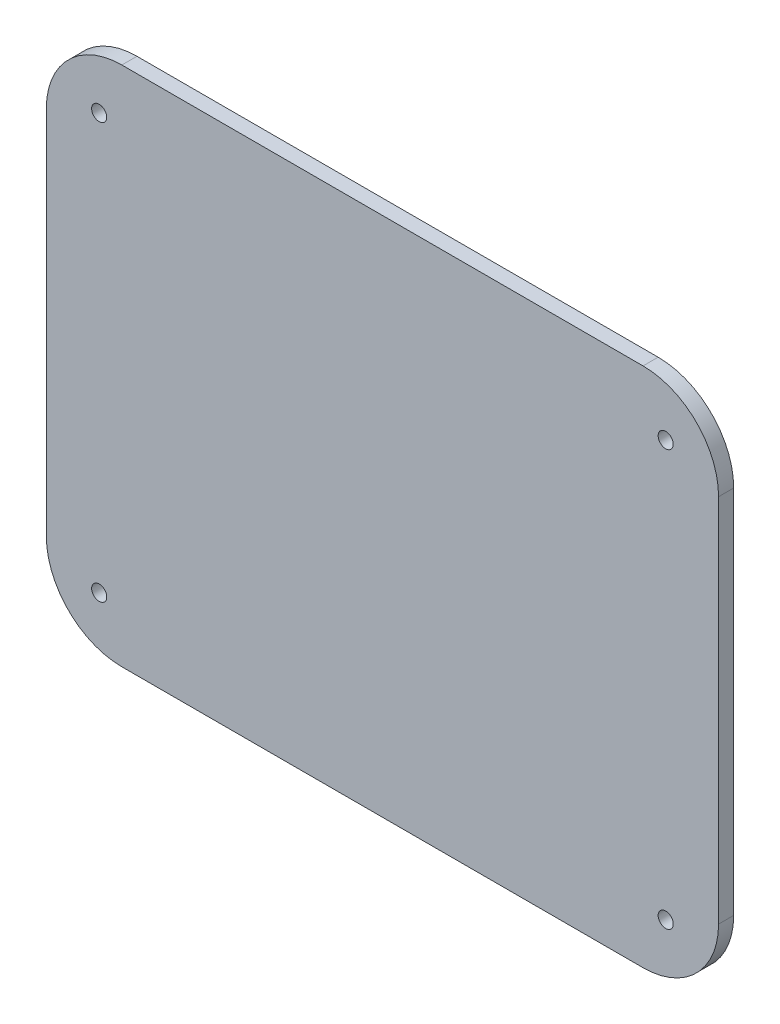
ISO-10303-21;
HEADER;
FILE_DESCRIPTION(('STEP AP214'),'2;1');
FILE_NAME('part.step','',(''),(''),'','','');
FILE_SCHEMA(('AUTOMOTIVE_DESIGN { 1 0 10303 214 1 1 1 1 }'));
ENDSEC;
DATA;
#1=APPLICATION_CONTEXT('core data for automotive mechanical design processes');
#2=APPLICATION_PROTOCOL_DEFINITION('international standard','automotive_design',2000,#1);
#3=PRODUCT_CONTEXT('',#1,'mechanical');
#4=PRODUCT('Part','Part','',(#3));
#5=PRODUCT_RELATED_PRODUCT_CATEGORY('part','',(#4));
#6=PRODUCT_DEFINITION_FORMATION('','',#4);
#7=PRODUCT_DEFINITION_CONTEXT('part definition',#1,'design');
#8=PRODUCT_DEFINITION('design','',#6,#7);
#9=PRODUCT_DEFINITION_SHAPE('','',#8);
#10=(LENGTH_UNIT() NAMED_UNIT(*) SI_UNIT(.MILLI.,.METRE.));
#11=(NAMED_UNIT(*) PLANE_ANGLE_UNIT() SI_UNIT($,.RADIAN.));
#12=(NAMED_UNIT(*) SI_UNIT($,.STERADIAN.) SOLID_ANGLE_UNIT());
#13=UNCERTAINTY_MEASURE_WITH_UNIT(LENGTH_MEASURE(1.E-05),#10,'distance_accuracy_value','');
#14=(GEOMETRIC_REPRESENTATION_CONTEXT(3) GLOBAL_UNCERTAINTY_ASSIGNED_CONTEXT((#13)) GLOBAL_UNIT_ASSIGNED_CONTEXT((#10,
#11,#12)) REPRESENTATION_CONTEXT('',''));
#15=CARTESIAN_POINT('',(0.,0.,0.));
#16=DIRECTION('',(0.,0.,1.));
#17=DIRECTION('',(1.,0.,0.));
#18=AXIS2_PLACEMENT_3D('',#15,#16,#17);
#19=CARTESIAN_POINT('',(79.,-59.,-2.));
#20=DIRECTION('',(0.,0.,1.));
#21=DIRECTION('',(1.,0.,0.));
#22=AXIS2_PLACEMENT_3D('',#19,#20,#21);
#23=CYLINDRICAL_SURFACE('',#22,9.99999999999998);
#24=CARTESIAN_POINT('',(79.,-59.,0.));
#25=DIRECTION('',(0.,0.,1.));
#26=DIRECTION('',(1.,0.,0.));
#27=AXIS2_PLACEMENT_3D('',#24,#25,#26);
#28=CIRCLE('',#27,9.99999999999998);
#29=CARTESIAN_POINT('',(79.,-69.,0.));
#30=VERTEX_POINT('',#29);
#31=CARTESIAN_POINT('',(89.,-59.,0.));
#32=VERTEX_POINT('',#31);
#33=EDGE_CURVE('E146',#30,#32,#28,.T.);
#34=ORIENTED_EDGE('',*,*,#33,.F.);
#35=DIRECTION('',(0.,0.,1.));
#36=VECTOR('',#35,1.);
#37=CARTESIAN_POINT('',(79.,-69.,-2.));
#38=LINE('',#37,#36);
#39=CARTESIAN_POINT('',(79.,-69.,-2.));
#40=VERTEX_POINT('',#39);
#41=EDGE_CURVE('E11',#40,#30,#38,.T.);
#42=ORIENTED_EDGE('',*,*,#41,.F.);
#43=CARTESIAN_POINT('',(79.,-59.,-2.));
#44=DIRECTION('',(0.,0.,1.));
#45=DIRECTION('',(1.,0.,0.));
#46=AXIS2_PLACEMENT_3D('',#43,#44,#45);
#47=CIRCLE('',#46,9.99999999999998);
#48=CARTESIAN_POINT('',(89.,-59.,-2.));
#49=VERTEX_POINT('',#48);
#50=EDGE_CURVE('E176',#40,#49,#47,.T.);
#51=ORIENTED_EDGE('',*,*,#50,.T.);
#52=DIRECTION('',(0.,0.,1.));
#53=VECTOR('',#52,1.);
#54=CARTESIAN_POINT('',(89.,-59.,-2.));
#55=LINE('',#54,#53);
#56=EDGE_CURVE('E40',#49,#32,#55,.T.);
#57=ORIENTED_EDGE('',*,*,#56,.T.);
#58=EDGE_LOOP('',(#34,#42,#51,#57));
#59=FACE_BOUND('',#58,.T.);
#60=ADVANCED_FACE('F37',(#59),#23,.T.);
#61=CARTESIAN_POINT('',(0.,-69.,-2.));
#62=DIRECTION('',(0.,-1.,0.));
#63=DIRECTION('',(0.,0.,-1.));
#64=AXIS2_PLACEMENT_3D('',#61,#62,#63);
#65=PLANE('',#64);
#66=DIRECTION('',(1.,0.,0.));
#67=VECTOR('',#66,1.);
#68=CARTESIAN_POINT('',(0.,-69.,0.));
#69=LINE('',#68,#67);
#70=CARTESIAN_POINT('',(10.0000000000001,-69.,0.));
#71=VERTEX_POINT('',#70);
#72=EDGE_CURVE('E162',#71,#30,#69,.T.);
#73=ORIENTED_EDGE('',*,*,#72,.F.);
#74=DIRECTION('',(0.,0.,1.));
#75=VECTOR('',#74,1.);
#76=CARTESIAN_POINT('',(10.0000000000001,-69.,-2.));
#77=LINE('',#76,#75);
#78=CARTESIAN_POINT('',(10.0000000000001,-69.,-2.));
#79=VERTEX_POINT('',#78);
#80=EDGE_CURVE('E46',#79,#71,#77,.T.);
#81=ORIENTED_EDGE('',*,*,#80,.F.);
#82=DIRECTION('',(1.,0.,0.));
#83=VECTOR('',#82,1.);
#84=CARTESIAN_POINT('',(0.,-69.,-2.));
#85=LINE('',#84,#83);
#86=EDGE_CURVE('E124',#79,#40,#85,.T.);
#87=ORIENTED_EDGE('',*,*,#86,.T.);
#88=ORIENTED_EDGE('',*,*,#41,.T.);
#89=EDGE_LOOP('',(#73,#81,#87,#88));
#90=FACE_BOUND('',#89,.T.);
#91=ADVANCED_FACE('F194',(#90),#65,.T.);
#92=CARTESIAN_POINT('',(10.,-59.,-2.));
#93=DIRECTION('',(0.,0.,1.));
#94=DIRECTION('',(1.,0.,0.));
#95=AXIS2_PLACEMENT_3D('',#92,#93,#94);
#96=CYLINDRICAL_SURFACE('',#95,10.);
#97=CARTESIAN_POINT('',(10.,-59.,0.));
#98=DIRECTION('',(0.,0.,1.));
#99=DIRECTION('',(1.,0.,0.));
#100=AXIS2_PLACEMENT_3D('',#97,#98,#99);
#101=CIRCLE('',#100,10.);
#102=CARTESIAN_POINT('',(0.,-58.9999999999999,0.));
#103=VERTEX_POINT('',#102);
#104=EDGE_CURVE('E111',#103,#71,#101,.T.);
#105=ORIENTED_EDGE('',*,*,#104,.F.);
#106=DIRECTION('',(0.,0.,1.));
#107=VECTOR('',#106,1.);
#108=CARTESIAN_POINT('',(0.,-58.9999999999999,-2.));
#109=LINE('',#108,#107);
#110=CARTESIAN_POINT('',(0.,-58.9999999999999,-2.));
#111=VERTEX_POINT('',#110);
#112=EDGE_CURVE('E106',#111,#103,#109,.T.);
#113=ORIENTED_EDGE('',*,*,#112,.F.);
#114=CARTESIAN_POINT('',(10.,-59.,-2.));
#115=DIRECTION('',(0.,0.,1.));
#116=DIRECTION('',(1.,0.,0.));
#117=AXIS2_PLACEMENT_3D('',#114,#115,#116);
#118=CIRCLE('',#117,10.);
#119=EDGE_CURVE('E109',#111,#79,#118,.T.);
#120=ORIENTED_EDGE('',*,*,#119,.T.);
#121=ORIENTED_EDGE('',*,*,#80,.T.);
#122=EDGE_LOOP('',(#105,#113,#120,#121));
#123=FACE_BOUND('',#122,.T.);
#124=ADVANCED_FACE('F108',(#123),#96,.T.);
#125=CARTESIAN_POINT('',(0.,0.,-2.));
#126=DIRECTION('',(-1.,0.,0.));
#127=DIRECTION('',(0.,-1.,0.));
#128=AXIS2_PLACEMENT_3D('',#125,#126,#127);
#129=PLANE('',#128);
#130=DIRECTION('',(0.,-1.,0.));
#131=VECTOR('',#130,1.);
#132=CARTESIAN_POINT('',(0.,0.,0.));
#133=LINE('',#132,#131);
#134=CARTESIAN_POINT('',(0.,-10.0000000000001,0.));
#135=VERTEX_POINT('',#134);
#136=EDGE_CURVE('E159',#135,#103,#133,.T.);
#137=ORIENTED_EDGE('',*,*,#136,.F.);
#138=DIRECTION('',(0.,0.,1.));
#139=VECTOR('',#138,1.);
#140=CARTESIAN_POINT('',(0.,-10.0000000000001,-2.));
#141=LINE('',#140,#139);
#142=CARTESIAN_POINT('',(0.,-10.0000000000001,-2.));
#143=VERTEX_POINT('',#142);
#144=EDGE_CURVE('E116',#143,#135,#141,.T.);
#145=ORIENTED_EDGE('',*,*,#144,.F.);
#146=DIRECTION('',(0.,-1.,0.));
#147=VECTOR('',#146,1.);
#148=CARTESIAN_POINT('',(0.,0.,-2.));
#149=LINE('',#148,#147);
#150=EDGE_CURVE('E122',#143,#111,#149,.T.);
#151=ORIENTED_EDGE('',*,*,#150,.T.);
#152=ORIENTED_EDGE('',*,*,#112,.T.);
#153=EDGE_LOOP('',(#137,#145,#151,#152));
#154=FACE_BOUND('',#153,.T.);
#155=ADVANCED_FACE('F126',(#154),#129,.T.);
#156=CARTESIAN_POINT('',(10.,-10.,-2.));
#157=DIRECTION('',(0.,0.,1.));
#158=DIRECTION('',(1.,0.,0.));
#159=AXIS2_PLACEMENT_3D('',#156,#157,#158);
#160=CYLINDRICAL_SURFACE('',#159,10.);
#161=CARTESIAN_POINT('',(10.,-10.,0.));
#162=DIRECTION('',(0.,0.,1.));
#163=DIRECTION('',(1.,0.,0.));
#164=AXIS2_PLACEMENT_3D('',#161,#162,#163);
#165=CIRCLE('',#164,10.);
#166=CARTESIAN_POINT('',(10.0000000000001,0.,0.));
#167=VERTEX_POINT('',#166);
#168=EDGE_CURVE('E156',#167,#135,#165,.T.);
#169=ORIENTED_EDGE('',*,*,#168,.F.);
#170=DIRECTION('',(0.,0.,1.));
#171=VECTOR('',#170,1.);
#172=CARTESIAN_POINT('',(10.0000000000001,0.,-2.));
#173=LINE('',#172,#171);
#174=CARTESIAN_POINT('',(10.0000000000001,0.,-2.));
#175=VERTEX_POINT('',#174);
#176=EDGE_CURVE('E180',#175,#167,#173,.T.);
#177=ORIENTED_EDGE('',*,*,#176,.F.);
#178=CARTESIAN_POINT('',(10.,-10.,-2.));
#179=DIRECTION('',(0.,0.,1.));
#180=DIRECTION('',(1.,0.,0.));
#181=AXIS2_PLACEMENT_3D('',#178,#179,#180);
#182=CIRCLE('',#181,10.);
#183=EDGE_CURVE('E127',#175,#143,#182,.T.);
#184=ORIENTED_EDGE('',*,*,#183,.T.);
#185=ORIENTED_EDGE('',*,*,#144,.T.);
#186=EDGE_LOOP('',(#169,#177,#184,#185));
#187=FACE_BOUND('',#186,.T.);
#188=ADVANCED_FACE('F208',(#187),#160,.T.);
#189=CARTESIAN_POINT('',(0.,0.,-2.));
#190=DIRECTION('',(0.,-1.,0.));
#191=DIRECTION('',(1.,0.,0.));
#192=AXIS2_PLACEMENT_3D('',#189,#190,#191);
#193=PLANE('',#192);
#194=DIRECTION('',(1.,0.,0.));
#195=VECTOR('',#194,1.);
#196=CARTESIAN_POINT('',(0.,0.,0.));
#197=LINE('',#196,#195);
#198=CARTESIAN_POINT('',(79.,0.,0.));
#199=VERTEX_POINT('',#198);
#200=EDGE_CURVE('E154',#167,#199,#197,.T.);
#201=ORIENTED_EDGE('',*,*,#200,.T.);
#202=DIRECTION('',(0.,0.,1.));
#203=VECTOR('',#202,1.);
#204=CARTESIAN_POINT('',(79.,0.,-2.));
#205=LINE('',#204,#203);
#206=CARTESIAN_POINT('',(79.,0.,-2.));
#207=VERTEX_POINT('',#206);
#208=EDGE_CURVE('E182',#207,#199,#205,.T.);
#209=ORIENTED_EDGE('',*,*,#208,.F.);
#210=DIRECTION('',(1.,0.,0.));
#211=VECTOR('',#210,1.);
#212=CARTESIAN_POINT('',(0.,0.,-2.));
#213=LINE('',#212,#211);
#214=EDGE_CURVE('E129',#175,#207,#213,.T.);
#215=ORIENTED_EDGE('',*,*,#214,.F.);
#216=ORIENTED_EDGE('',*,*,#176,.T.);
#217=EDGE_LOOP('',(#201,#209,#215,#216));
#218=FACE_BOUND('',#217,.T.);
#219=ADVANCED_FACE('F211',(#218),#193,.F.);
#220=CARTESIAN_POINT('',(79.,-10.,-2.));
#221=DIRECTION('',(0.,0.,1.));
#222=DIRECTION('',(1.,0.,0.));
#223=AXIS2_PLACEMENT_3D('',#220,#221,#222);
#224=CYLINDRICAL_SURFACE('',#223,9.99999999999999);
#225=CARTESIAN_POINT('',(79.,-10.,0.));
#226=DIRECTION('',(0.,0.,1.));
#227=DIRECTION('',(1.,0.,0.));
#228=AXIS2_PLACEMENT_3D('',#225,#226,#227);
#229=CIRCLE('',#228,9.99999999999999);
#230=CARTESIAN_POINT('',(89.,-10.,0.));
#231=VERTEX_POINT('',#230);
#232=EDGE_CURVE('E152',#199,#231,#229,.F.);
#233=ORIENTED_EDGE('',*,*,#232,.T.);
#234=DIRECTION('',(0.,0.,1.));
#235=VECTOR('',#234,1.);
#236=CARTESIAN_POINT('',(89.,-10.,-2.));
#237=LINE('',#236,#235);
#238=CARTESIAN_POINT('',(89.,-10.,-2.));
#239=VERTEX_POINT('',#238);
#240=EDGE_CURVE('E184',#239,#231,#237,.T.);
#241=ORIENTED_EDGE('',*,*,#240,.F.);
#242=CARTESIAN_POINT('',(79.,-10.,-2.));
#243=DIRECTION('',(0.,0.,1.));
#244=DIRECTION('',(1.,0.,0.));
#245=AXIS2_PLACEMENT_3D('',#242,#243,#244);
#246=CIRCLE('',#245,9.99999999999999);
#247=EDGE_CURVE('E384',#207,#239,#246,.F.);
#248=ORIENTED_EDGE('',*,*,#247,.F.);
#249=ORIENTED_EDGE('',*,*,#208,.T.);
#250=EDGE_LOOP('',(#233,#241,#248,#249));
#251=FACE_BOUND('',#250,.T.);
#252=ADVANCED_FACE('F215',(#251),#224,.T.);
#253=CARTESIAN_POINT('',(82.,-7.00000000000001,-2.));
#254=DIRECTION('',(0.,0.,1.));
#255=DIRECTION('',(1.,0.,0.));
#256=AXIS2_PLACEMENT_3D('',#253,#254,#255);
#257=CYLINDRICAL_SURFACE('',#256,0.999999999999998);
#258=CARTESIAN_POINT('',(82.,-7.00000000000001,-2.));
#259=DIRECTION('',(0.,0.,1.));
#260=DIRECTION('',(1.,0.,0.));
#261=AXIS2_PLACEMENT_3D('',#258,#259,#260);
#262=CIRCLE('',#261,0.999999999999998);
#263=CARTESIAN_POINT('',(83.,-7.00000000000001,-2.));
#264=VERTEX_POINT('',#263);
#265=EDGE_CURVE('E140',#264,#264,#262,.F.);
#266=ORIENTED_EDGE('',*,*,#265,.T.);
#267=EDGE_LOOP('',(#266));
#268=FACE_BOUND('',#267,.T.);
#269=CARTESIAN_POINT('',(82.,-7.00000000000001,0.));
#270=DIRECTION('',(0.,0.,1.));
#271=DIRECTION('',(1.,0.,0.));
#272=AXIS2_PLACEMENT_3D('',#269,#270,#271);
#273=CIRCLE('',#272,0.999999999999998);
#274=CARTESIAN_POINT('',(83.,-7.00000000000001,0.));
#275=VERTEX_POINT('',#274);
#276=EDGE_CURVE('E171',#275,#275,#273,.F.);
#277=ORIENTED_EDGE('',*,*,#276,.F.);
#278=EDGE_LOOP('',(#277));
#279=FACE_BOUND('',#278,.T.);
#280=ADVANCED_FACE('F218',(#268,#279),#257,.F.);
#281=CARTESIAN_POINT('',(7.,-62.,-2.));
#282=DIRECTION('',(0.,0.,1.));
#283=DIRECTION('',(1.,0.,0.));
#284=AXIS2_PLACEMENT_3D('',#281,#282,#283);
#285=CYLINDRICAL_SURFACE('',#284,1.);
#286=CARTESIAN_POINT('',(7.,-62.,-2.));
#287=DIRECTION('',(0.,0.,1.));
#288=DIRECTION('',(1.,0.,0.));
#289=AXIS2_PLACEMENT_3D('',#286,#287,#288);
#290=CIRCLE('',#289,1.);
#291=CARTESIAN_POINT('',(8.,-62.,-2.));
#292=VERTEX_POINT('',#291);
#293=EDGE_CURVE('E137',#292,#292,#290,.F.);
#294=ORIENTED_EDGE('',*,*,#293,.T.);
#295=EDGE_LOOP('',(#294));
#296=FACE_BOUND('',#295,.T.);
#297=CARTESIAN_POINT('',(7.,-62.,0.));
#298=DIRECTION('',(0.,0.,1.));
#299=DIRECTION('',(1.,0.,0.));
#300=AXIS2_PLACEMENT_3D('',#297,#298,#299);
#301=CIRCLE('',#300,1.);
#302=CARTESIAN_POINT('',(8.,-62.,0.));
#303=VERTEX_POINT('',#302);
#304=EDGE_CURVE('E168',#303,#303,#301,.F.);
#305=ORIENTED_EDGE('',*,*,#304,.F.);
#306=EDGE_LOOP('',(#305));
#307=FACE_BOUND('',#306,.T.);
#308=ADVANCED_FACE('F228',(#296,#307),#285,.F.);
#309=CARTESIAN_POINT('',(7.,-7.,-2.));
#310=DIRECTION('',(0.,0.,1.));
#311=DIRECTION('',(1.,0.,0.));
#312=AXIS2_PLACEMENT_3D('',#309,#310,#311);
#313=CYLINDRICAL_SURFACE('',#312,1.);
#314=CARTESIAN_POINT('',(7.,-7.,-2.));
#315=DIRECTION('',(0.,0.,1.));
#316=DIRECTION('',(1.,0.,0.));
#317=AXIS2_PLACEMENT_3D('',#314,#315,#316);
#318=CIRCLE('',#317,1.);
#319=CARTESIAN_POINT('',(8.,-7.,-2.));
#320=VERTEX_POINT('',#319);
#321=EDGE_CURVE('E134',#320,#320,#318,.T.);
#322=ORIENTED_EDGE('',*,*,#321,.F.);
#323=EDGE_LOOP('',(#322));
#324=FACE_BOUND('',#323,.T.);
#325=CARTESIAN_POINT('',(7.,-7.,0.));
#326=DIRECTION('',(0.,0.,1.));
#327=DIRECTION('',(1.,0.,0.));
#328=AXIS2_PLACEMENT_3D('',#325,#326,#327);
#329=CIRCLE('',#328,1.);
#330=CARTESIAN_POINT('',(8.,-7.,0.));
#331=VERTEX_POINT('',#330);
#332=EDGE_CURVE('E165',#331,#331,#329,.T.);
#333=ORIENTED_EDGE('',*,*,#332,.T.);
#334=EDGE_LOOP('',(#333));
#335=FACE_BOUND('',#334,.T.);
#336=ADVANCED_FACE('F203',(#324,#335),#313,.F.);
#337=CARTESIAN_POINT('',(89.,0.,-2.));
#338=DIRECTION('',(-1.,0.,0.));
#339=DIRECTION('',(0.,0.,1.));
#340=AXIS2_PLACEMENT_3D('',#337,#338,#339);
#341=PLANE('',#340);
#342=DIRECTION('',(0.,-1.,0.));
#343=VECTOR('',#342,1.);
#344=CARTESIAN_POINT('',(89.,0.,0.));
#345=LINE('',#344,#343);
#346=EDGE_CURVE('E149',#231,#32,#345,.T.);
#347=ORIENTED_EDGE('',*,*,#346,.T.);
#348=ORIENTED_EDGE('',*,*,#56,.F.);
#349=DIRECTION('',(0.,-1.,0.));
#350=VECTOR('',#349,1.);
#351=CARTESIAN_POINT('',(89.,0.,-2.));
#352=LINE('',#351,#350);
#353=EDGE_CURVE('E93',#239,#49,#352,.T.);
#354=ORIENTED_EDGE('',*,*,#353,.F.);
#355=ORIENTED_EDGE('',*,*,#240,.T.);
#356=EDGE_LOOP('',(#347,#348,#354,#355));
#357=FACE_BOUND('',#356,.T.);
#358=ADVANCED_FACE('F189',(#357),#341,.F.);
#359=CARTESIAN_POINT('',(82.,-62.,-2.));
#360=DIRECTION('',(0.,0.,1.));
#361=DIRECTION('',(1.,0.,0.));
#362=AXIS2_PLACEMENT_3D('',#359,#360,#361);
#363=CYLINDRICAL_SURFACE('',#362,0.999999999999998);
#364=CARTESIAN_POINT('',(82.,-62.,-2.));
#365=DIRECTION('',(0.,0.,1.));
#366=DIRECTION('',(1.,0.,0.));
#367=AXIS2_PLACEMENT_3D('',#364,#365,#366);
#368=CIRCLE('',#367,0.999999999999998);
#369=CARTESIAN_POINT('',(83.,-62.,-2.));
#370=VERTEX_POINT('',#369);
#371=EDGE_CURVE('E143',#370,#370,#368,.T.);
#372=ORIENTED_EDGE('',*,*,#371,.F.);
#373=EDGE_LOOP('',(#372));
#374=FACE_BOUND('',#373,.T.);
#375=CARTESIAN_POINT('',(82.,-62.,0.));
#376=DIRECTION('',(0.,0.,1.));
#377=DIRECTION('',(1.,0.,0.));
#378=AXIS2_PLACEMENT_3D('',#375,#376,#377);
#379=CIRCLE('',#378,0.999999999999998);
#380=CARTESIAN_POINT('',(83.,-62.,0.));
#381=VERTEX_POINT('',#380);
#382=EDGE_CURVE('E174',#381,#381,#379,.T.);
#383=ORIENTED_EDGE('',*,*,#382,.T.);
#384=EDGE_LOOP('',(#383));
#385=FACE_BOUND('',#384,.T.);
#386=ADVANCED_FACE('F221',(#374,#385),#363,.F.);
#387=CARTESIAN_POINT('',(0.,0.,-2.));
#388=DIRECTION('',(0.,0.,1.));
#389=DIRECTION('',(1.,0.,0.));
#390=AXIS2_PLACEMENT_3D('',#387,#388,#389);
#391=PLANE('',#390);
#392=ORIENTED_EDGE('',*,*,#50,.F.);
#393=ORIENTED_EDGE('',*,*,#86,.F.);
#394=ORIENTED_EDGE('',*,*,#119,.F.);
#395=ORIENTED_EDGE('',*,*,#150,.F.);
#396=ORIENTED_EDGE('',*,*,#183,.F.);
#397=ORIENTED_EDGE('',*,*,#214,.T.);
#398=ORIENTED_EDGE('',*,*,#247,.T.);
#399=ORIENTED_EDGE('',*,*,#353,.T.);
#400=EDGE_LOOP('',(#392,#393,#394,#395,#396,#397,#398,#399));
#401=FACE_BOUND('',#400,.T.);
#402=ORIENTED_EDGE('',*,*,#321,.T.);
#403=EDGE_LOOP('',(#402));
#404=FACE_BOUND('',#403,.T.);
#405=ORIENTED_EDGE('',*,*,#293,.F.);
#406=EDGE_LOOP('',(#405));
#407=FACE_BOUND('',#406,.T.);
#408=ORIENTED_EDGE('',*,*,#265,.F.);
#409=EDGE_LOOP('',(#408));
#410=FACE_BOUND('',#409,.T.);
#411=ORIENTED_EDGE('',*,*,#371,.T.);
#412=EDGE_LOOP('',(#411));
#413=FACE_BOUND('',#412,.T.);
#414=ADVANCED_FACE('F119',(#401,#404,#407,#410,#413),#391,.F.);
#415=CARTESIAN_POINT('',(0.,0.,0.));
#416=DIRECTION('',(0.,0.,1.));
#417=DIRECTION('',(1.,0.,0.));
#418=AXIS2_PLACEMENT_3D('',#415,#416,#417);
#419=PLANE('',#418);
#420=ORIENTED_EDGE('',*,*,#33,.T.);
#421=ORIENTED_EDGE('',*,*,#346,.F.);
#422=ORIENTED_EDGE('',*,*,#232,.F.);
#423=ORIENTED_EDGE('',*,*,#200,.F.);
#424=ORIENTED_EDGE('',*,*,#168,.T.);
#425=ORIENTED_EDGE('',*,*,#136,.T.);
#426=ORIENTED_EDGE('',*,*,#104,.T.);
#427=ORIENTED_EDGE('',*,*,#72,.T.);
#428=EDGE_LOOP('',(#420,#421,#422,#423,#424,#425,#426,#427));
#429=FACE_BOUND('',#428,.T.);
#430=ORIENTED_EDGE('',*,*,#332,.F.);
#431=EDGE_LOOP('',(#430));
#432=FACE_BOUND('',#431,.T.);
#433=ORIENTED_EDGE('',*,*,#304,.T.);
#434=EDGE_LOOP('',(#433));
#435=FACE_BOUND('',#434,.T.);
#436=ORIENTED_EDGE('',*,*,#276,.T.);
#437=EDGE_LOOP('',(#436));
#438=FACE_BOUND('',#437,.T.);
#439=ORIENTED_EDGE('',*,*,#382,.F.);
#440=EDGE_LOOP('',(#439));
#441=FACE_BOUND('',#440,.T.);
#442=ADVANCED_FACE('F192',(#429,#432,#435,#438,#441),#419,.T.);
#443=CLOSED_SHELL('',(#60,#91,#124,#155,#188,#219,#252,#280,#308,#336,#358,#386,#414,#442));
#444=MANIFOLD_SOLID_BREP('B2',#443);
#445=ADVANCED_BREP_SHAPE_REPRESENTATION('',(#18,#444),#14);
#446=SHAPE_DEFINITION_REPRESENTATION(#9,#445);
ENDSEC;
END-ISO-10303-21;
